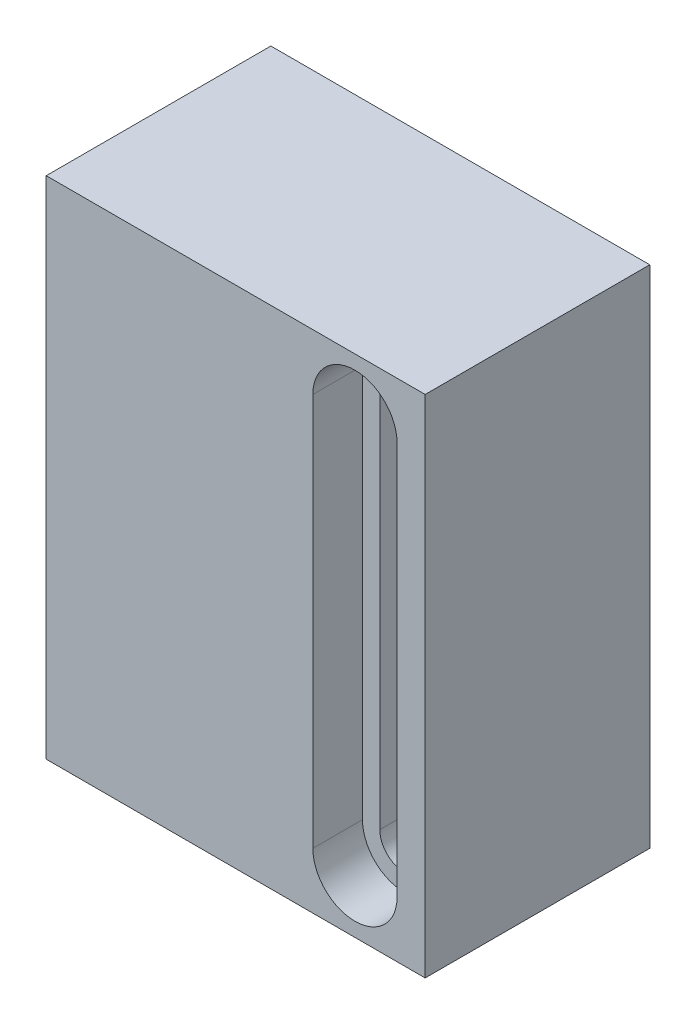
from build123d import *

# Parameters (mm, degrees)
SKETCH1_W           = 42.8498
SKETCH1_H           = 25.4
BOSS_EXTRUDE1_DEPTH = 57.15
CUT_EXTRUDE1_DEPTH  = 5.6134
CUT_EXTRUDE2_START  = -5.6134
CUT_EXTRUDE2_DEPTH  = 5.6134
CUT_EXTRUDE3_DEPTH  = 65.161190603


with BuildPart() as part:
    # Sketch1 → Boss-Extrude1 (new body)
    with BuildSketch(Plane(origin=(0, 0, 0), x_dir=(1, 0, 0), z_dir=(0, 1, 0))):
        Rectangle(SKETCH1_W, SKETCH1_H)
    extrude(amount=BOSS_EXTRUDE1_DEPTH)

    # Sketch2 → Cut-Extrude1 (cut)
    with BuildSketch(Plane.XY.offset(12.7)):
        with BuildLine():
            Line((8.7249, 6.35), (8.7249, 50.8))
            ThreePointArc((8.7249, 50.8), (13.4874, 55.5625), (18.2499, 50.8))
            Line((18.2499, 50.8), (18.2499, 6.35))
            ThreePointArc((18.2499, 6.35), (13.4874, 1.5875), (8.7249, 6.35))
        make_face()
    extrude(amount=-CUT_EXTRUDE1_DEPTH, mode=Mode.SUBTRACT)

    # Sketch3 → Cut-Extrude2 (cut)
    with BuildSketch(Plane(origin=(0, 0, -12.7), x_dir=(-1, 0, 0), z_dir=(0, 0, -1)).offset(CUT_EXTRUDE2_START)):
        with BuildLine():
            Line((-8.7249, 6.35), (-8.7249, 50.8))
            ThreePointArc((-8.7249, 50.8), (-13.4874, 55.5625), (-18.2499, 50.8))
            Line((-18.2499, 50.8), (-18.2499, 6.35))
            ThreePointArc((-18.2499, 6.35), (-13.4874, 1.5875), (-8.7249, 6.35))
        make_face()
    extrude(amount=CUT_EXTRUDE2_DEPTH, mode=Mode.SUBTRACT)

    # Sketch4 → Cut-Extrude3 (cut, through all)
    with BuildSketch(Plane.XY.offset(7.0866)):
        with BuildLine():
            Line((10.6807, 6.35), (10.6807, 50.8))
            ThreePointArc((10.6807, 50.8), (13.4874, 53.6067), (16.2941, 50.8))
            Line((16.2941, 50.8), (16.2941, 6.35))
            ThreePointArc((16.2941, 6.35), (13.4874, 3.5433), (10.6807, 6.35))
        make_face()
    extrude(amount=-CUT_EXTRUDE3_DEPTH, mode=Mode.SUBTRACT)


solid = part.part
